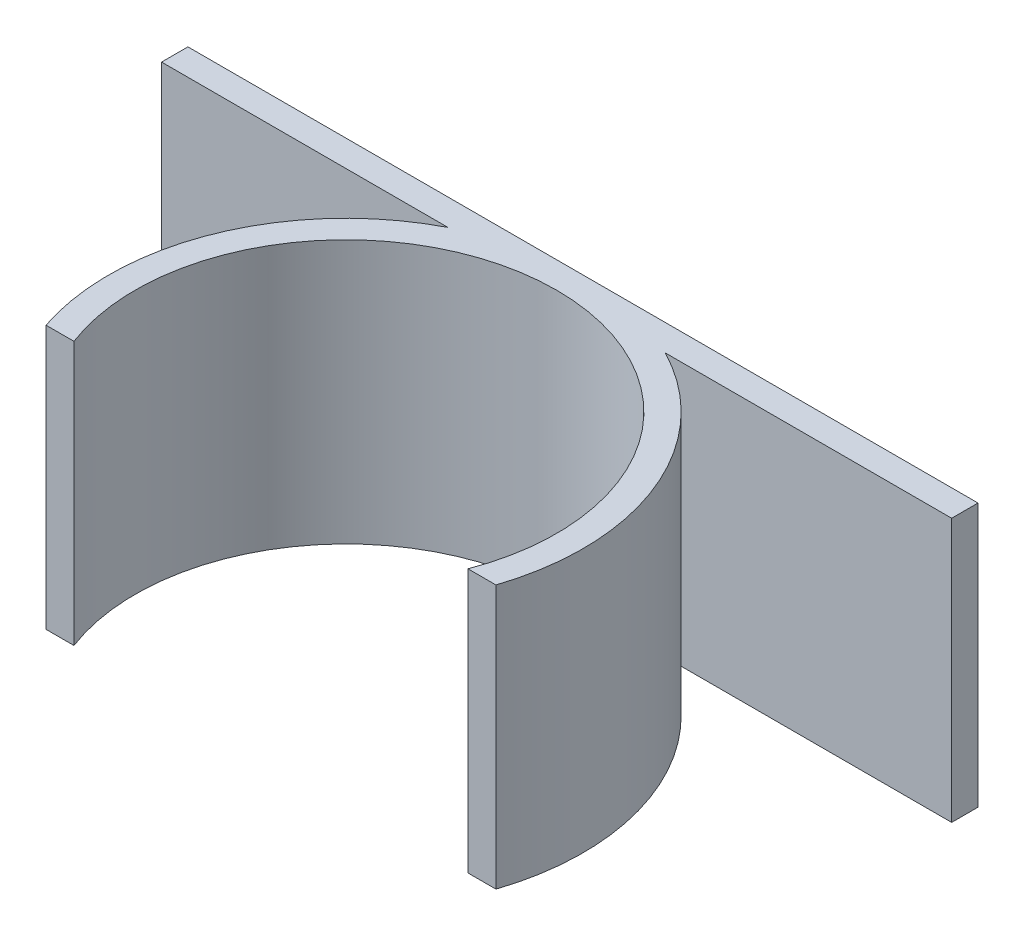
from build123d import *

# Parameters (mm, degrees)
SKETCH_1_R          = 9
SKETCH_1_R_2        = 8
EXTRUDE_1_DEPTH     = 10
EXTRUDE_2_DEPTH     = 10
SKETCH_3_W          = 18
SKETCH_3_H          = 5.60637426
CUT_EXTRUDE_2_DEPTH = 10
SKETCH_5_W          = 17.917057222
SKETCH_5_H          = 0.707675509
CUT_EXTRUDE_3_DEPTH = 10


with BuildPart() as part:
    # Sketch 1 → Extrude 1 (new body)
    with BuildSketch(Plane(origin=(0, 0, 0), x_dir=(1, 0, 0), z_dir=(0, 1, 0))):
        with Locations(Location((0, 0, 0), (0, 0, 270))):
            Circle(SKETCH_1_R)
        with Locations(Location((0, 0, 0), (0, 0, 270))):
            Circle(SKETCH_1_R_2, mode=Mode.SUBTRACT)
    extrude(amount=EXTRUDE_1_DEPTH)

    # Sketch 2 → Extrude 2 (add)
    with BuildSketch(Plane.XZ):
        with BuildLine():
            ThreePointArc((4.123105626, -8), (2.121320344, -8.746427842), (0, -9))
            Line((0, -9), (14.994909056, -9))
            Line((14.994909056, -9), (14.994909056, -8))
            Line((14.994909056, -8), (4.123105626, -8))
        make_face()
        with BuildLine():
            Line((-14.994909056, -9), (0, -9))
            ThreePointArc((0, -9), (-2.121320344, -8.746427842), (-4.123105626, -8))
            Line((-4.123105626, -8), (-14.994909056, -8))
            Line((-14.994909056, -8), (-14.994909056, -9))
        make_face()
    extrude(amount=-EXTRUDE_2_DEPTH)

    # Sketch 3 → Cut-Extrude 2 (cut)
    with BuildSketch(Plane.XZ):
        with Locations((0, 6.19681287)):
            Rectangle(SKETCH_3_W, SKETCH_3_H)
    extrude(amount=-CUT_EXTRUDE_2_DEPTH, mode=Mode.SUBTRACT)

    # Sketch 5 → Cut-Extrude 3 (cut)
    with BuildSketch(Plane.XZ):
        with Locations((0.176918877, 3.195971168)):
            Rectangle(SKETCH_5_W, SKETCH_5_H)
    extrude(amount=-CUT_EXTRUDE_3_DEPTH, mode=Mode.SUBTRACT)


solid = part.part
